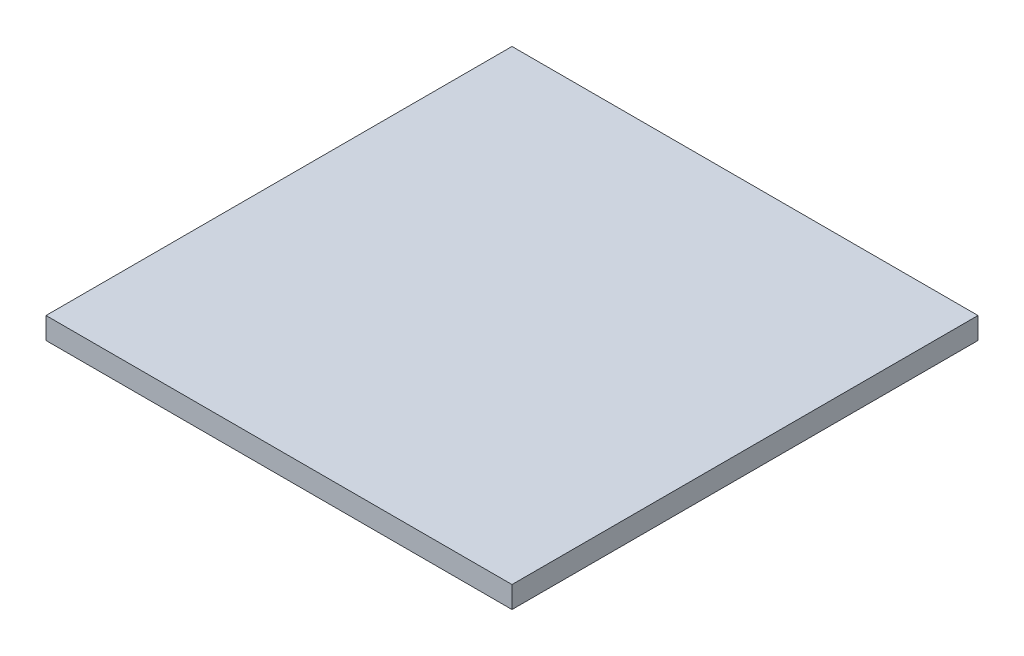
from build123d import *

# Parameters (mm, degrees)
SKETCH1_W           = 43
SKETCH1_H           = 43
BOSS_EXTRUDE1_DEPTH = 2


with BuildPart() as part:
    # Sketch1 → Boss-Extrude1 (new body)
    with BuildSketch(Plane(origin=(0, 0, 0), x_dir=(1, 0, 0), z_dir=(0, 1, 0))):
        Rectangle(SKETCH1_W, SKETCH1_H)
    extrude(amount=BOSS_EXTRUDE1_DEPTH)


solid = part.part
